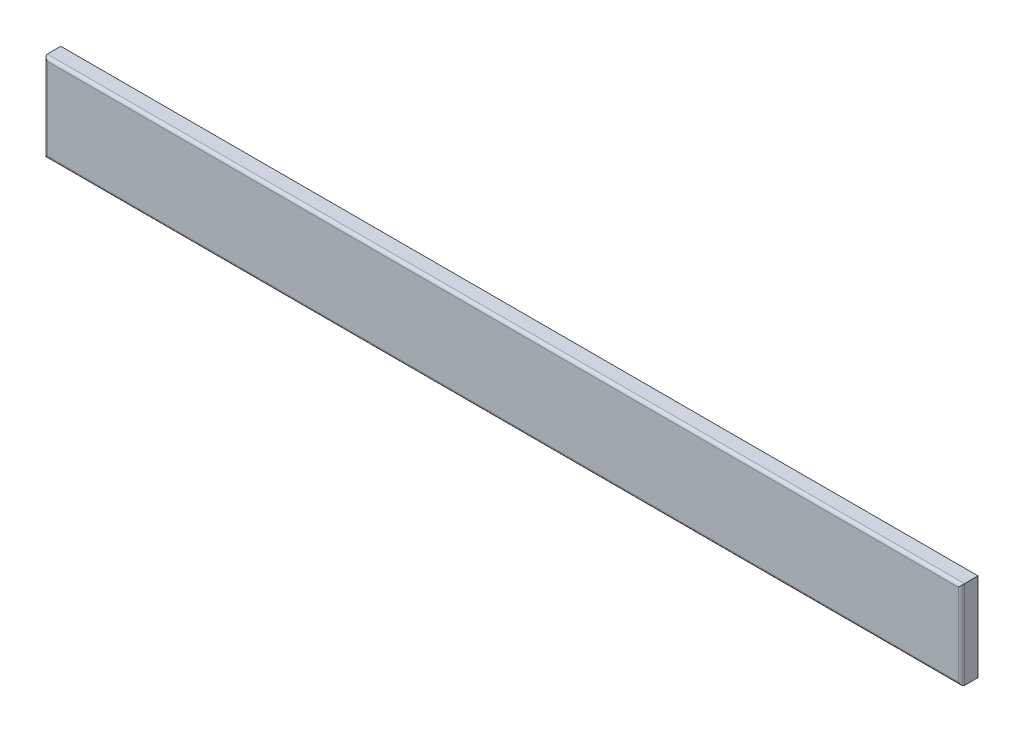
from build123d import *

# Parameters (mm, degrees)
SKETCH_1_W      = 884.2
SKETCH_1_H      = 85
EXTRUDE_1_DEPTH = 16
FILLET_1_R      = 3


with BuildPart() as part:
    # Sketch 1 → Extrude 1 (new body)
    with BuildSketch(Plane.XY):
        with Locations((0, 1047.3)):
            Rectangle(SKETCH_1_W, SKETCH_1_H)
    extrude(amount=EXTRUDE_1_DEPTH)

    # Fillet 1
    fillet_1_edges = [part.edges().sort_by_distance(p)[0] for p in [
        (442.1, 1047.3, 16),
        (0, 1089.8, 16),
        (-442.1, 1047.3, 16),
        (0, 1004.8, 16),
    ]]
    fillet(fillet_1_edges, radius=FILLET_1_R)


solid = part.part
